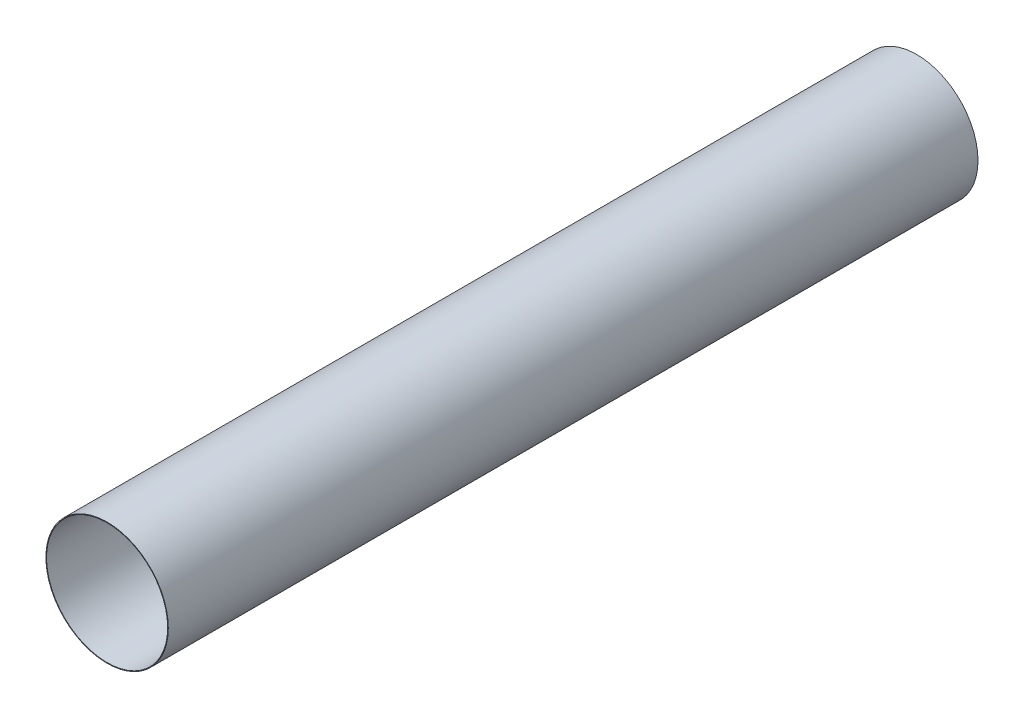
ISO-10303-21;
HEADER;
FILE_DESCRIPTION(('STEP AP214'),'2;1');
FILE_NAME('part.step','',(''),(''),'','','');
FILE_SCHEMA(('AUTOMOTIVE_DESIGN { 1 0 10303 214 1 1 1 1 }'));
ENDSEC;
DATA;
#1=APPLICATION_CONTEXT('core data for automotive mechanical design processes');
#2=APPLICATION_PROTOCOL_DEFINITION('international standard','automotive_design',2000,#1);
#3=PRODUCT_CONTEXT('',#1,'mechanical');
#4=PRODUCT('Part','Part','',(#3));
#5=PRODUCT_RELATED_PRODUCT_CATEGORY('part','',(#4));
#6=PRODUCT_DEFINITION_FORMATION('','',#4);
#7=PRODUCT_DEFINITION_CONTEXT('part definition',#1,'design');
#8=PRODUCT_DEFINITION('design','',#6,#7);
#9=PRODUCT_DEFINITION_SHAPE('','',#8);
#10=(LENGTH_UNIT() NAMED_UNIT(*) SI_UNIT(.MILLI.,.METRE.));
#11=(NAMED_UNIT(*) PLANE_ANGLE_UNIT() SI_UNIT($,.RADIAN.));
#12=(NAMED_UNIT(*) SI_UNIT($,.STERADIAN.) SOLID_ANGLE_UNIT());
#13=UNCERTAINTY_MEASURE_WITH_UNIT(LENGTH_MEASURE(1.E-05),#10,'distance_accuracy_value','');
#14=(GEOMETRIC_REPRESENTATION_CONTEXT(3) GLOBAL_UNCERTAINTY_ASSIGNED_CONTEXT((#13)) GLOBAL_UNIT_ASSIGNED_CONTEXT((#10,
#11,#12)) REPRESENTATION_CONTEXT('',''));
#15=CARTESIAN_POINT('',(0.,0.,0.));
#16=DIRECTION('',(0.,0.,1.));
#17=DIRECTION('',(1.,0.,0.));
#18=AXIS2_PLACEMENT_3D('',#15,#16,#17);
#19=CARTESIAN_POINT('',(0.,0.,-254.));
#20=DIRECTION('',(0.,0.,1.));
#21=DIRECTION('',(1.,0.,0.));
#22=AXIS2_PLACEMENT_3D('',#19,#20,#21);
#23=CYLINDRICAL_SURFACE('',#22,19.2);
#24=CARTESIAN_POINT('',(0.,0.,-254.));
#25=DIRECTION('',(0.,0.,1.));
#26=DIRECTION('',(1.,0.,0.));
#27=AXIS2_PLACEMENT_3D('',#24,#25,#26);
#28=CIRCLE('',#27,19.2);
#29=CARTESIAN_POINT('',(19.2,0.,-254.));
#30=VERTEX_POINT('',#29);
#31=EDGE_CURVE('E10',#30,#30,#28,.T.);
#32=ORIENTED_EDGE('',*,*,#31,.T.);
#33=EDGE_LOOP('',(#32));
#34=FACE_BOUND('',#33,.T.);
#35=CARTESIAN_POINT('',(0.,0.,0.));
#36=DIRECTION('',(0.,0.,1.));
#37=DIRECTION('',(1.,0.,0.));
#38=AXIS2_PLACEMENT_3D('',#35,#36,#37);
#39=CIRCLE('',#38,19.2);
#40=CARTESIAN_POINT('',(19.2,0.,0.));
#41=VERTEX_POINT('',#40);
#42=EDGE_CURVE('E40',#41,#41,#39,.T.);
#43=ORIENTED_EDGE('',*,*,#42,.F.);
#44=EDGE_LOOP('',(#43));
#45=FACE_BOUND('',#44,.T.);
#46=ADVANCED_FACE('F37',(#34,#45),#23,.T.);
#47=CARTESIAN_POINT('',(0.,0.,-254.));
#48=DIRECTION('',(0.,0.,1.));
#49=DIRECTION('',(1.,0.,0.));
#50=AXIS2_PLACEMENT_3D('',#47,#48,#49);
#51=PLANE('',#50);
#52=CARTESIAN_POINT('',(0.,0.,-254.));
#53=DIRECTION('',(0.,0.,1.));
#54=DIRECTION('',(1.,0.,0.));
#55=AXIS2_PLACEMENT_3D('',#52,#53,#54);
#56=CIRCLE('',#55,19.);
#57=CARTESIAN_POINT('',(19.,0.,-254.));
#58=VERTEX_POINT('',#57);
#59=EDGE_CURVE('E47',#58,#58,#56,.T.);
#60=ORIENTED_EDGE('',*,*,#59,.T.);
#61=EDGE_LOOP('',(#60));
#62=FACE_BOUND('',#61,.T.);
#63=ORIENTED_EDGE('',*,*,#31,.F.);
#64=EDGE_LOOP('',(#63));
#65=FACE_BOUND('',#64,.T.);
#66=ADVANCED_FACE('F55',(#62,#65),#51,.F.);
#67=CARTESIAN_POINT('',(0.,0.,0.));
#68=DIRECTION('',(0.,0.,1.));
#69=DIRECTION('',(1.,0.,0.));
#70=AXIS2_PLACEMENT_3D('',#67,#68,#69);
#71=PLANE('',#70);
#72=CARTESIAN_POINT('',(0.,0.,0.));
#73=DIRECTION('',(0.,0.,1.));
#74=DIRECTION('',(1.,0.,0.));
#75=AXIS2_PLACEMENT_3D('',#72,#73,#74);
#76=CIRCLE('',#75,19.);
#77=CARTESIAN_POINT('',(19.,0.,0.));
#78=VERTEX_POINT('',#77);
#79=EDGE_CURVE('E49',#78,#78,#76,.T.);
#80=ORIENTED_EDGE('',*,*,#79,.F.);
#81=EDGE_LOOP('',(#80));
#82=FACE_BOUND('',#81,.T.);
#83=ORIENTED_EDGE('',*,*,#42,.T.);
#84=EDGE_LOOP('',(#83));
#85=FACE_BOUND('',#84,.T.);
#86=ADVANCED_FACE('F61',(#82,#85),#71,.T.);
#87=CARTESIAN_POINT('',(0.,0.,-254.));
#88=DIRECTION('',(0.,0.,1.));
#89=DIRECTION('',(1.,0.,0.));
#90=AXIS2_PLACEMENT_3D('',#87,#88,#89);
#91=CYLINDRICAL_SURFACE('',#90,19.);
#92=ORIENTED_EDGE('',*,*,#59,.F.);
#93=EDGE_LOOP('',(#92));
#94=FACE_BOUND('',#93,.T.);
#95=ORIENTED_EDGE('',*,*,#79,.T.);
#96=EDGE_LOOP('',(#95));
#97=FACE_BOUND('',#96,.T.);
#98=ADVANCED_FACE('F58',(#94,#97),#91,.F.);
#99=CLOSED_SHELL('',(#46,#66,#86,#98));
#100=MANIFOLD_SOLID_BREP('B2',#99);
#101=ADVANCED_BREP_SHAPE_REPRESENTATION('',(#18,#100),#14);
#102=SHAPE_DEFINITION_REPRESENTATION(#9,#101);
ENDSEC;
END-ISO-10303-21;
